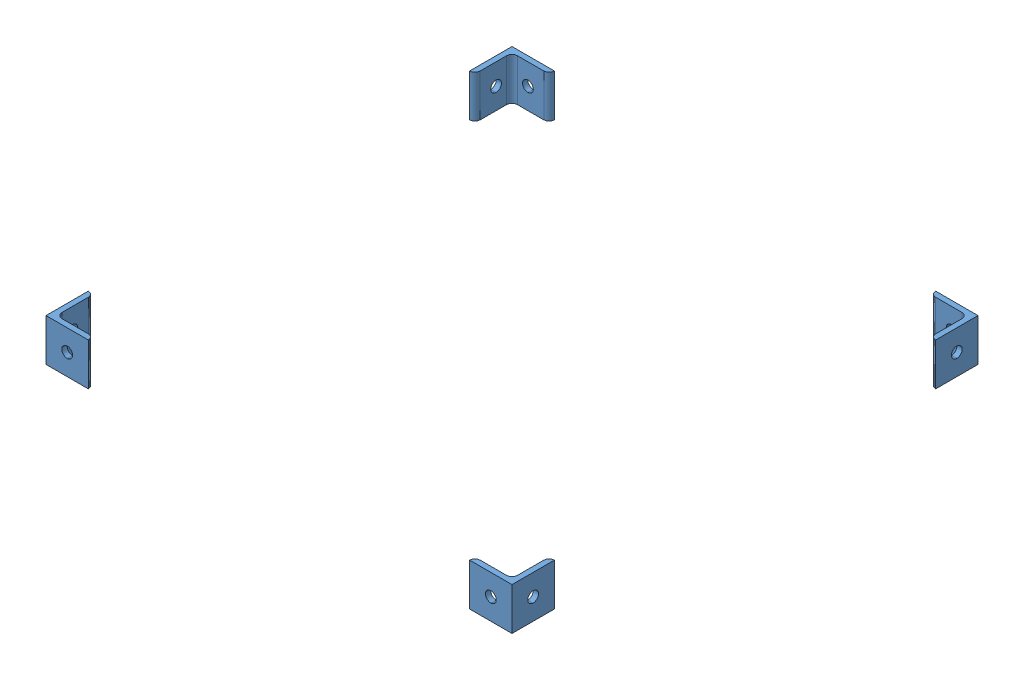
SolidWorks assembly Platform2.SLDASM, configuration Default (file format 9000). Lengths in mm.
Overall size (330.2 25.4 330.2).
8 component instances, 2 part files, 21 mates.
Components (placement in the parent):
- Beams12in-7: Beams12in.sldprt [Default] at origin size (25.4 25.4 304.8)
- Beams12in-5: Beams12in.sldprt [Default] at (317.5 0 -12.7) x (0 0 -1) z (1 0 0) size (25.4 25.4 304.8)
- Beams12in-6: Beams12in.sldprt [Default] at (292.1 0 -317.5) x (0 0 -1) z (1 0 0) size (25.4 25.4 304.8)
- Beams12in-8: Beams12in.sldprt [Default] at (304.8 0 -25.4) size (25.4 25.4 304.8)
- Corner bracket-1: Corner bracket.sldprt [Default] at (12.7 0 -25.4) x (0 -1 0) z (1 0 0) size (25.4 25.4 25.4)
- Corner bracket-2: Corner bracket.sldprt [Default] at (292.1 0 -304.8) x (0 1 0) z (0 0 1) size (25.4 25.4 25.4)
- Corner bracket-3: Corner bracket.sldprt [Default] at (292.1 0 -25.4) x (0 1 0) z (-1 0 0) size (25.4 25.4 25.4)
- Corner bracket-4: Corner bracket.sldprt [Default] at (12.7 0 -304.8) x (0 -1 0) z (0 0 1) size (25.4 25.4 25.4)
Mates (geometry in assembly coordinates):
- Coincident2: coincident anti-aligned: plane of Beams12in-7 through (12.7 6.3331 -304.8) normal (1 0 0); plane of Corner bracket-1 through (12.7 -12.7 -25.4) normal (-1 0 0)
- Coincident3: coincident aligned: plane of Beams12in-7 through (9.5504 12.7 -304.8) normal (0 1 0); plane of Corner bracket-1 through (34.925 12.7 -25.4) normal (0 1 0)
- Coincident4: coincident anti-aligned: plane of Beams12in-5 through (12.7 6.3331 -25.4) normal (0 0 -1); plane of Corner bracket-1 through (38.1 -12.7 -25.4) normal (0 0 1)
- Coincident5: coincident aligned: plane of Beams12in-5 through (12.7 12.7 -22.2504) normal (0 1 0); plane of Corner bracket-1 through (34.925 12.7 -25.4) normal (0 1 0)
- Coincident6: coincident anti-aligned: plane of Beams12in-7 through (12.7 6.3331 -304.8) normal (1 0 0); plane of Beams12in-5 through (12.7 -10.0584 0) normal (-1 0 0)
- Coincident7: coincident aligned: plane of Beams12in-7 through (-12.7 -10.0584 0) normal (0 0 1); plane of Beams12in-5 through (12.7 9.5504 0) normal (0 0 1)
- Coincident9: coincident anti-aligned: plane of Beams12in-5 through (12.7 6.3331 -25.4) normal (0 0 -1); plane of Beams12in-8 through (292.1 -10.0584 -25.4) normal (0 0 1)
- Coincident10: coincident aligned: plane of Beams12in-5 through (317.5 -10.0584 0) normal (1 0 0); plane of Beams12in-8 through (317.5 6.3331 -330.2) normal (1 0 0)
- Coincident11: coincident aligned: plane of Beams12in-5 through (12.7 -12.7 -3.1496) normal (0 -1 0); plane of Beams12in-8 through (311.1331 -12.7 -330.2) normal (0 -1 0)
- Coincident15: coincident anti-aligned: plane of Beams12in-5 through (12.7 6.3331 -25.4) normal (0 0 -1); plane of Corner bracket-3 through (266.7 12.7 -25.4) normal (0 0 1)
- Coincident16: coincident anti-aligned: plane of Beams12in-8 through (292.1 9.5504 -330.2) normal (-1 0 0); plane of Corner bracket-3 through (292.1 12.7 -25.4) normal (1 0 0)
- Coincident17: coincident aligned: plane of Beams12in-5 through (12.7 12.7 -22.2504) normal (0 1 0); plane of Corner bracket-3 through (269.875 12.7 -25.4) normal (0 1 0)
- Coincident18: coincident aligned: plane of Beams12in-6 through (-12.7 6.3331 -330.2) normal (0 0 -1); plane of Beams12in-8 through (292.1 -10.0584 -330.2) normal (0 0 -1)
- Coincident19: coincident anti-aligned: plane of Beams12in-6 through (292.1 -10.0584 -304.8) normal (1 0 0); plane of Beams12in-8 through (292.1 9.5504 -330.2) normal (-1 0 0)
- Coincident20: coincident aligned: plane of Beams12in-6 through (-12.7 12.7 -311.1669) normal (0 1 0); plane of Beams12in-8 through (298.4669 12.7 -330.2) normal (0 1 0)
- Coincident21: coincident anti-aligned: plane of Beams12in-8 through (292.1 9.5504 -330.2) normal (-1 0 0); plane of Corner bracket-2 through (292.1 12.7 -279.4) normal (1 0 0)
- Coincident22: coincident anti-aligned: plane of Beams12in-6 through (-12.7 9.5504 -304.8) normal (0 0 1); plane of Corner bracket-2 through (292.1 12.7 -304.8) normal (0 0 -1)
- Coincident23: coincident aligned: plane of Beams12in-8 through (298.4669 12.7 -330.2) normal (0 1 0); plane of Corner bracket-2 through (292.1 12.7 -282.575) normal (0 1 0)
- Coincident24: coincident anti-aligned: plane of Beams12in-6 through (-12.7 9.5504 -304.8) normal (0 0 1); plane of Corner bracket-4 through (12.7 -12.7 -304.8) normal (0 0 -1)
- Coincident25: coincident anti-aligned: plane of Beams12in-7 through (12.7 6.3331 -304.8) normal (1 0 0); plane of Corner bracket-4 through (12.7 -12.7 -279.4) normal (-1 0 0)
- Coincident26: coincident aligned: plane of Beams12in-7 through (9.5504 12.7 -304.8) normal (0 1 0); plane of Corner bracket-4 through (12.7 12.7 -282.575) normal (0 1 0)
